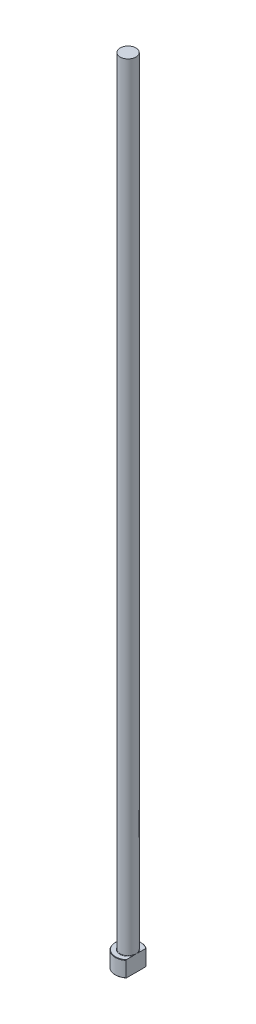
from build123d import *
from build123d.topology import SkipClean

# Parameters (mm, degrees)
CHAMFER1_SIZE    = 0.2
FILLET1_R        = 0.2
KEYED_HEAD_DEPTH = 401.105611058


with BuildPart() as part:
    # Sketch1 → Revolve1 (revolve)
    with BuildSketch(Plane.XY, mode=Mode.PRIVATE) as revolve1_sk:
        Polygon((0, 0), (-6.5, 0), (-6.5, 8), (-4, 8), (-4, 400), (0, 400), align=None)
    revolve(revolve1_sk.sketch.rotate(Axis((0, 259.958771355, 0), (0, -1, 0)), 270), axis=Axis((0, 259.958771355, 0), (0, -1, 0)))

    # Chamfer1
    chamfer1_edges = [part.edges().sort_by_distance(p)[0] for p in [
        (0, 8, -6.5),
        (0, 0, -6.5),
    ]]
    chamfer(chamfer1_edges, length=CHAMFER1_SIZE)

    # Fillet1
    fillet1_edges = [part.edges().sort_by_distance(p)[0] for p in [
        (0, 8, -4),
    ]]
    fillet(fillet1_edges, radius=FILLET1_R)

    # Sketch2 → KEYED HEAD (cut, through all)
    with SkipClean():  # the faces are left unmerged after this step: merging them gives an invalid solid
        with BuildSketch(Plane(origin=(0, 0, 0), x_dir=(1, 0, 0), z_dir=(0, 1, 0))):
            with BuildLine():
                Line((4, -5.123475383), (4, 5.123475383))
                ThreePointArc((4, 5.123475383), (6.5, 0), (4, -5.123475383))
            make_face()
        extrude(amount=KEYED_HEAD_DEPTH, mode=Mode.SUBTRACT)


solid = part.part
